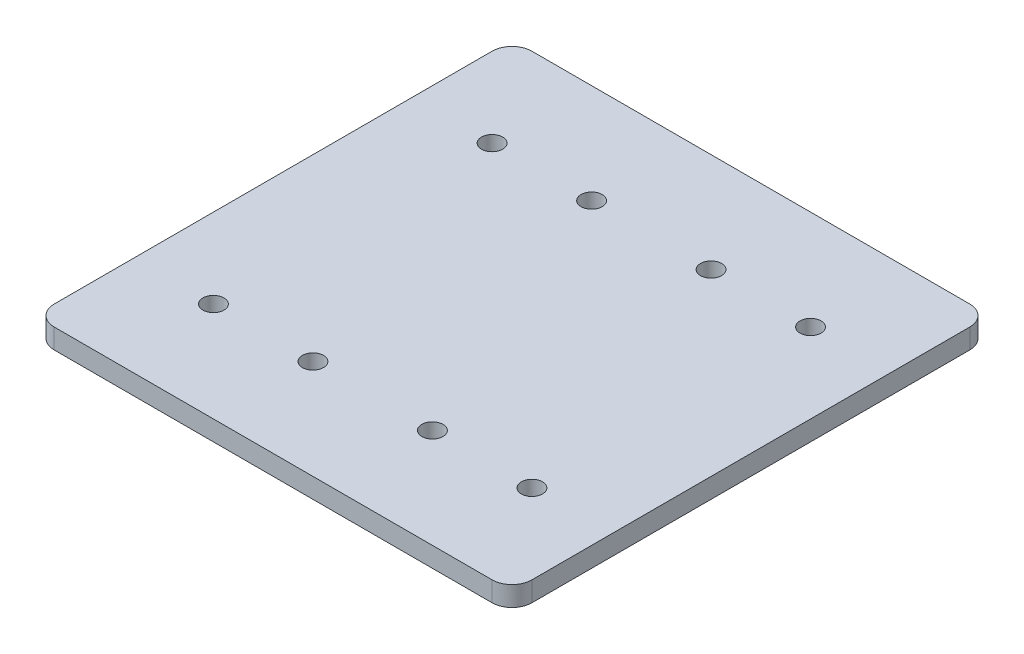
from build123d import *

# Parameters (mm, degrees)
SKETCH1_R      = 3.37312
EXTRUDE1_DEPTH = 6.35


with BuildPart() as part:
    # Sketch1 → Extrude1 (new body)
    with BuildSketch(Plane(origin=(0, 0, 0), x_dir=(1, 0, 0), z_dir=(0, 1, 0))):
        with BuildLine():
            Line((6.35, 0), (146.05, 0))
            ThreePointArc((146.05, 0), (150.540128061, 1.859871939), (152.4, 6.35))
            Line((152.4, 6.35), (152.4, 146.05))
            ThreePointArc((152.4, 146.05), (150.540128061, 150.540128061), (146.05, 152.4))
            Line((146.05, 152.4), (6.35, 152.4))
            ThreePointArc((6.35, 152.4), (1.859871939, 150.540128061), (0, 146.05))
            Line((0, 146.05), (0, 6.35))
            ThreePointArc((0, 6.35), (1.859871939, 1.859871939), (6.35, 0))
        make_face()
        with Locations(Location((25.4, 31.75, 0), (0, 0, 270))):
            Circle(SKETCH1_R, mode=Mode.SUBTRACT)
        with Locations(Location((57.15, 31.75, 0), (0, 0, 270))):
            Circle(SKETCH1_R, mode=Mode.SUBTRACT)
        with Locations(Location((25.4, 120.65, 0), (0, 0, 90))):
            Circle(SKETCH1_R, mode=Mode.SUBTRACT)
        with Locations(Location((57.15, 120.65, 0), (0, 0, 90))):
            Circle(SKETCH1_R, mode=Mode.SUBTRACT)
        with Locations(Location((127, 31.75, 0), (0, 0, 90))):
            Circle(SKETCH1_R, mode=Mode.SUBTRACT)
        with Locations(Location((127, 120.65, 0), (0, 0, 270))):
            Circle(SKETCH1_R, mode=Mode.SUBTRACT)
        with Locations(Location((95.25, 120.65, 0), (0, 0, 270))):
            Circle(SKETCH1_R, mode=Mode.SUBTRACT)
        with Locations(Location((95.25, 31.75, 0), (0, 0, 90))):
            Circle(SKETCH1_R, mode=Mode.SUBTRACT)
    extrude(amount=EXTRUDE1_DEPTH)


solid = part.part
